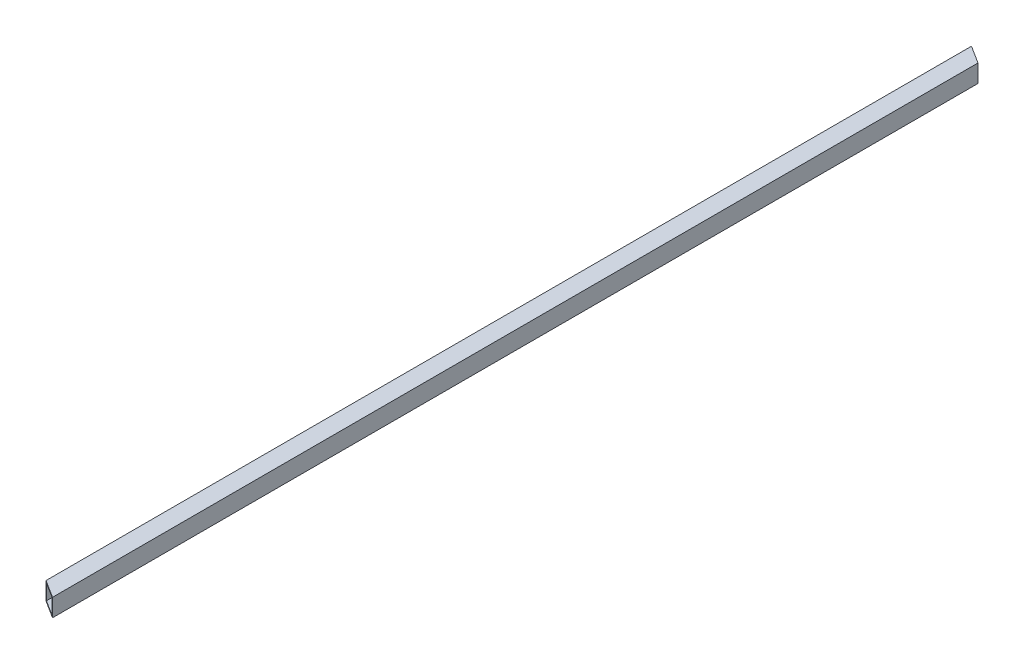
from build123d import *

# Parameters (mm, degrees)
SKETCH1_W      = 50.8
SKETCH1_H      = 50.8
SKETCH1_W_2    = 44.45
SKETCH1_H_2    = 44.45
EXTRUDE1_DEPTH = 2677.0203
EXTRUDE2_DEPTH = 2678.984123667


with BuildPart() as part:
    # Sketch1 → Extrude1 (new body)
    with BuildSketch(Plane.XY):
        with Locations((25.4, 25.4)):
            Rectangle(SKETCH1_W, SKETCH1_H)
        with Locations((25.4, 25.4)):
            Rectangle(SKETCH1_W_2, SKETCH1_H_2, mode=Mode.SUBTRACT)
    extrude(amount=EXTRUDE1_DEPTH)

    # Sketch2 → Extrude2 (cut, through all)
    with BuildSketch(Plane.XZ):
        Polygon((-62.49547155, 2677.0203), (-62.49547155, 2605.412868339), (50.8, 2677.0203), align=None)
        Polygon((160.00309794, 101.128586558), (160.00309794, 0), (0, 0), align=None)
    extrude(amount=-EXTRUDE2_DEPTH, mode=Mode.SUBTRACT)


solid = part.part
